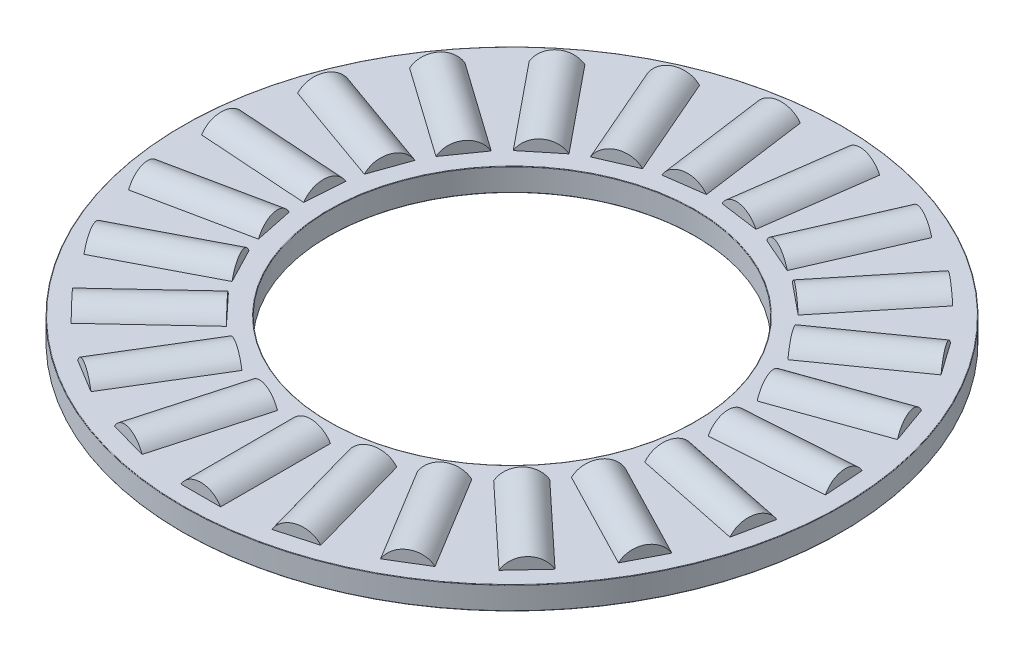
from build123d import *

# Parameters (mm, degrees)
SKETCH1_W         = 6.35
SKETCH1_H         = 0.9921875
SKETCH3_W         = 4.7625
SKETCH3_H         = 0.9921875
SKETCH2_W         = 4.7625
SKETCH2_H         = 0.9921875
CIRPATTERN1_COUNT = 23
CIRPATTERN1_ANGLE = 344.347826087
CIRPATTERN2_COUNT = 23
FILLET2_R         = 0.01984375


with BuildPart() as part:
    # Sketch1 → Revolve1 (revolve)
    with BuildSketch(Plane(origin=(0, 0, 0), x_dir=(0, 0, -1), z_dir=(1, 0, 0)), mode=Mode.PRIVATE) as revolve1_sk:
        with Locations((-11.1125, 0)):
            Rectangle(SKETCH1_W, SKETCH1_H)
    revolve(revolve1_sk.sketch.rotate(Axis((0, -0.9921875, 0), (0, 1, 0)), 180), axis=Axis((0, -0.9921875, 0), (0, 1, 0)))

    # Sketch3 → Cut-Revolve1 (revolve, cut)
    with BuildSketch(Plane(origin=(0, 0, 0), x_dir=(0, 0, -1), z_dir=(1, 0, 0))):
        with Locations((-11.1125, 0.49609375)):
            Rectangle(SKETCH3_W, SKETCH3_H)
    cut_revolve1 = revolve(axis=Axis((0, 0, 13.49375), (0, 0, -1)), mode=Mode.SUBTRACT)

    # CirPattern2: Cut-Revolve1 ×23 about axis
    cirpattern2_axis = Axis((0, 0, 0), (0, 1, 0))
    for i in range(1, CIRPATTERN2_COUNT):
        add(cut_revolve1.rotate(cirpattern2_axis, i * 360 / CIRPATTERN2_COUNT), mode=Mode.SUBTRACT)

    # Fillet2
    fillet2_edges = [part.edges().sort_by_distance(p)[0] for p in [
        (0, 0.49609375, 14.2875),
        (0, 0.49609375, 7.9375),
        (0, -0.49609375, 7.9375),
        (0, -0.49609375, 14.2875),
    ]]
    fillet(fillet2_edges, radius=FILLET2_R)


with BuildPart() as body_2:
    # Sketch2 → Revolve2 (revolve)
    with BuildSketch(Plane(origin=(0, 0, 0), x_dir=(0, 0, -1), z_dir=(1, 0, 0)), mode=Mode.PRIVATE) as revolve2_sk:
        with Locations((-11.1125, 0.49609375)):
            Rectangle(SKETCH2_W, SKETCH2_H)
    revolve(revolve2_sk.sketch.rotate(Axis((0, 0, 13.49375), (0, 0, -1)), 90), axis=Axis((0, 0, 13.49375), (0, 0, -1)))


with BuildPart() as cirpattern1_1:
    # CirPattern1: pattern copy
    add(body_2.part.rotate(Axis((0, 0.9921875, 0), (0, -1, 0)), 1 * CIRPATTERN1_ANGLE / (CIRPATTERN1_COUNT - 1)))


with BuildPart() as cirpattern1_2:
    # CirPattern1: pattern copy
    add(body_2.part.rotate(Axis((0, 0.9921875, 0), (0, -1, 0)), 2 * CIRPATTERN1_ANGLE / (CIRPATTERN1_COUNT - 1)))


with BuildPart() as cirpattern1_3:
    # CirPattern1: pattern copy
    add(body_2.part.rotate(Axis((0, 0.9921875, 0), (0, -1, 0)), 3 * CIRPATTERN1_ANGLE / (CIRPATTERN1_COUNT - 1)))


with BuildPart() as cirpattern1_4:
    # CirPattern1: pattern copy
    add(body_2.part.rotate(Axis((0, 0.9921875, 0), (0, -1, 0)), 4 * CIRPATTERN1_ANGLE / (CIRPATTERN1_COUNT - 1)))


with BuildPart() as cirpattern1_5:
    # CirPattern1: pattern copy
    add(body_2.part.rotate(Axis((0, 0.9921875, 0), (0, -1, 0)), 5 * CIRPATTERN1_ANGLE / (CIRPATTERN1_COUNT - 1)))


with BuildPart() as cirpattern1_6:
    # CirPattern1: pattern copy
    add(body_2.part.rotate(Axis((0, 0.9921875, 0), (0, -1, 0)), 6 * CIRPATTERN1_ANGLE / (CIRPATTERN1_COUNT - 1)))


with BuildPart() as cirpattern1_7:
    # CirPattern1: pattern copy
    add(body_2.part.rotate(Axis((0, 0.9921875, 0), (0, -1, 0)), 7 * CIRPATTERN1_ANGLE / (CIRPATTERN1_COUNT - 1)))


with BuildPart() as cirpattern1_8:
    # CirPattern1: pattern copy
    add(body_2.part.rotate(Axis((0, 0.9921875, 0), (0, -1, 0)), 8 * CIRPATTERN1_ANGLE / (CIRPATTERN1_COUNT - 1)))


with BuildPart() as cirpattern1_9:
    # CirPattern1: pattern copy
    add(body_2.part.rotate(Axis((0, 0.9921875, 0), (0, -1, 0)), 9 * CIRPATTERN1_ANGLE / (CIRPATTERN1_COUNT - 1)))


with BuildPart() as cirpattern1_10:
    # CirPattern1: pattern copy
    add(body_2.part.rotate(Axis((0, 0.9921875, 0), (0, -1, 0)), 10 * CIRPATTERN1_ANGLE / (CIRPATTERN1_COUNT - 1)))


with BuildPart() as cirpattern1_11:
    # CirPattern1: pattern copy
    add(body_2.part.rotate(Axis((0, 0.9921875, 0), (0, -1, 0)), 11 * CIRPATTERN1_ANGLE / (CIRPATTERN1_COUNT - 1)))


with BuildPart() as cirpattern1_12:
    # CirPattern1: pattern copy
    add(body_2.part.rotate(Axis((0, 0.9921875, 0), (0, -1, 0)), 12 * CIRPATTERN1_ANGLE / (CIRPATTERN1_COUNT - 1)))


with BuildPart() as cirpattern1_13:
    # CirPattern1: pattern copy
    add(body_2.part.rotate(Axis((0, 0.9921875, 0), (0, -1, 0)), 13 * CIRPATTERN1_ANGLE / (CIRPATTERN1_COUNT - 1)))


with BuildPart() as cirpattern1_14:
    # CirPattern1: pattern copy
    add(body_2.part.rotate(Axis((0, 0.9921875, 0), (0, -1, 0)), 14 * CIRPATTERN1_ANGLE / (CIRPATTERN1_COUNT - 1)))


with BuildPart() as cirpattern1_15:
    # CirPattern1: pattern copy
    add(body_2.part.rotate(Axis((0, 0.9921875, 0), (0, -1, 0)), 15 * CIRPATTERN1_ANGLE / (CIRPATTERN1_COUNT - 1)))


with BuildPart() as cirpattern1_16:
    # CirPattern1: pattern copy
    add(body_2.part.rotate(Axis((0, 0.9921875, 0), (0, -1, 0)), 16 * CIRPATTERN1_ANGLE / (CIRPATTERN1_COUNT - 1)))


with BuildPart() as cirpattern1_17:
    # CirPattern1: pattern copy
    add(body_2.part.rotate(Axis((0, 0.9921875, 0), (0, -1, 0)), 17 * CIRPATTERN1_ANGLE / (CIRPATTERN1_COUNT - 1)))


with BuildPart() as cirpattern1_18:
    # CirPattern1: pattern copy
    add(body_2.part.rotate(Axis((0, 0.9921875, 0), (0, -1, 0)), 18 * CIRPATTERN1_ANGLE / (CIRPATTERN1_COUNT - 1)))


with BuildPart() as cirpattern1_19:
    # CirPattern1: pattern copy
    add(body_2.part.rotate(Axis((0, 0.9921875, 0), (0, -1, 0)), 19 * CIRPATTERN1_ANGLE / (CIRPATTERN1_COUNT - 1)))


with BuildPart() as cirpattern1_20:
    # CirPattern1: pattern copy
    add(body_2.part.rotate(Axis((0, 0.9921875, 0), (0, -1, 0)), 20 * CIRPATTERN1_ANGLE / (CIRPATTERN1_COUNT - 1)))


with BuildPart() as cirpattern1_21:
    # CirPattern1: pattern copy
    add(body_2.part.rotate(Axis((0, 0.9921875, 0), (0, -1, 0)), 21 * CIRPATTERN1_ANGLE / (CIRPATTERN1_COUNT - 1)))


with BuildPart() as cirpattern1_22:
    # CirPattern1: pattern copy
    add(body_2.part.rotate(Axis((0, 0.9921875, 0), (0, -1, 0)), 22 * CIRPATTERN1_ANGLE / (CIRPATTERN1_COUNT - 1)))


solid = Compound([part.part, body_2.part, cirpattern1_1.part, cirpattern1_2.part, cirpattern1_3.part, cirpattern1_4.part, cirpattern1_5.part, cirpattern1_6.part, cirpattern1_7.part, cirpattern1_8.part, cirpattern1_9.part, cirpattern1_10.part, cirpattern1_11.part, cirpattern1_12.part, cirpattern1_13.part, cirpattern1_14.part, cirpattern1_15.part, cirpattern1_16.part, cirpattern1_17.part, cirpattern1_18.part, cirpattern1_19.part, cirpattern1_20.part, cirpattern1_21.part, cirpattern1_22.part])
